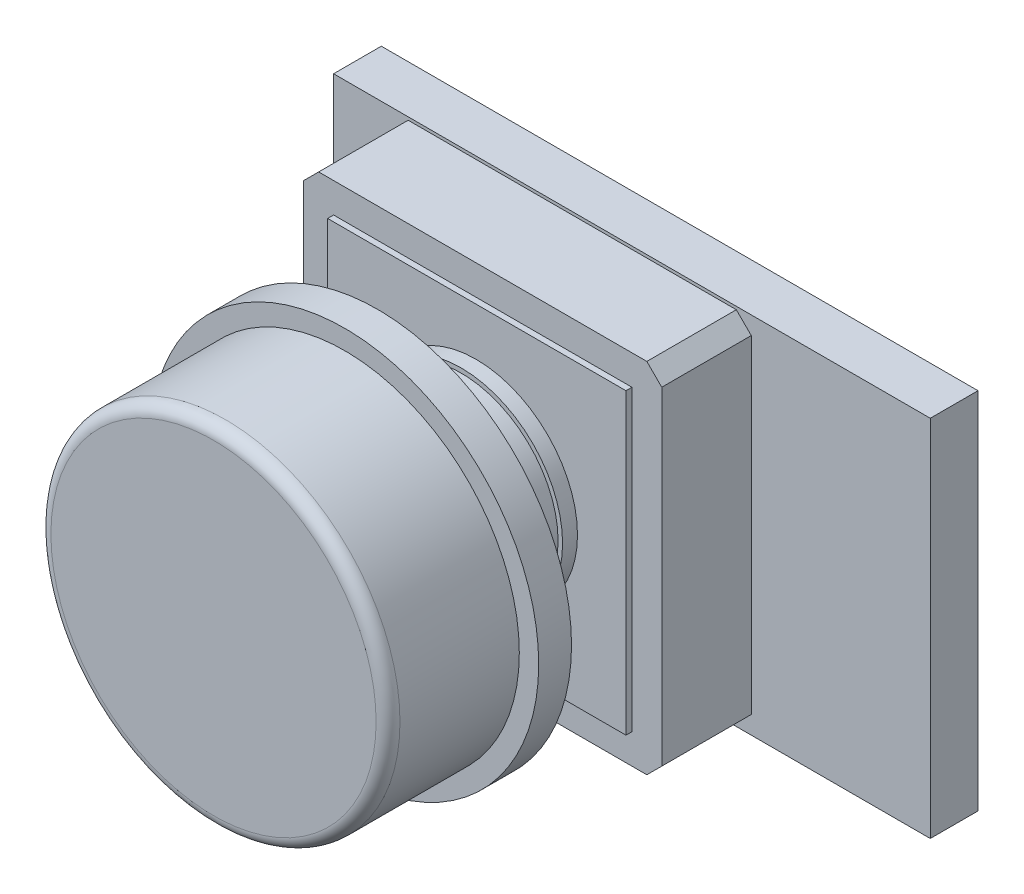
from build123d import *

# Parameters (mm, degrees)
SKETCH1_W           = 20
SKETCH1_H           = 12.2
BOSS_EXTRUDE1_DEPTH = 1.6
BOSS_EXTRU_1_DEPTH  = 3
ESQUISSE2_W         = 10
ESQUISSE2_H         = 10
BOSS_EXTRU_2_DEPTH  = 0.2
ESQUISSE3_R         = 3.4
BOSS_EXTRU_3_DEPTH  = 0.5
ESQUISSE5_W         = 1.960547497
ESQUISSE5_H         = 1.176328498
BOSS_EXTRU_4_DEPTH  = 0.5
BOSS_EXTRU_5_DEPTH  = 0.1


with BuildPart() as part:
    # Sketch1 → Boss-Extrude1 (new body)
    with BuildSketch(Plane.XY):
        with Locations((-3, 0)):
            Rectangle(SKETCH1_W, SKETCH1_H)
    extrude(amount=-BOSS_EXTRUDE1_DEPTH)

    # Esquisse1 → Boss.-Extru.1 (add)
    with BuildSketch(Plane.XY):
        Polygon((-10.5, 6), (0.5, 6), (1, 5.5), (1, -5.5), (0.5, -6), (-10.5, -6), (-11, -5.5), (-11, 5.5), align=None)
    extrude(amount=BOSS_EXTRU_1_DEPTH)

    # Esquisse2 → Boss.-Extru.2 (add)
    with BuildSketch(Plane.XY.offset(3)):
        with Locations((-5, 0)):
            Rectangle(ESQUISSE2_W, ESQUISSE2_H)
    extrude(amount=BOSS_EXTRU_2_DEPTH)

    # Esquisse3 → Boss.-Extru.3 (add)
    with BuildSketch(Plane.XY.offset(3.2)):
        with Locations(Location((-5.024392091, 0, 0), (0, 0, 180))):
            Circle(ESQUISSE3_R)
    extrude(amount=BOSS_EXTRU_3_DEPTH)

    # Esquisse4 → R_volution1 (revolve)
    with BuildSketch(Plane(origin=(0, 0, 0), x_dir=(1, 0, 0), z_dir=(0, 1, 0))):
        with BuildLine():
            Line((-5.024392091, -3.7), (-1.774392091, -3.7))
            Line((-1.774392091, -3.7), (-1.774392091, -6.5))
            Line((-1.774392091, -6.5), (1.475607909, -6.5))
            Line((1.475607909, -6.5), (1.475607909, -7.6))
            Line((1.475607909, -7.6), (0.825607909, -7.6))
            Line((0.825607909, -7.6), (0.825607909, -11.6))
            ThreePointArc((0.825607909, -11.6), (0.708450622, -11.882842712), (0.425607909, -12))
            Line((0.425607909, -12), (-5.024392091, -12))
            Line((-5.024392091, -12), (-5.024392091, -3.7))
        make_face()
    revolve(axis=Axis((-5.024392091, 0, 12), (0, 0, -1)))

    # Esquisse5 → Boss.-Extru.4 (add)
    with BuildSketch(Plane(origin=(0, 0, -1.6), x_dir=(-1, 0, 0), z_dir=(0, 0, -1))):
        with Locations((-2.67402441, 4.914439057)):
            Rectangle(ESQUISSE5_W, ESQUISSE5_H)
    extrude(amount=BOSS_EXTRU_4_DEPTH)

    # Esquisse6 → Boss.-Extru.5 (add)
    # profile 1 of 2: a face of its own
    with BuildSketch(Plane(origin=(0, 0, -1.6), x_dir=(-1, 0, 0), z_dir=(0, 0, -1))):
        with BuildLine():
            Line((-0.859748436, 5.483118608), (-0.659628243, 5.483118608))
            add(Edge.make_bspline(
                [(-0.659628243, 5.483118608), (-0.646273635, 5.483074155), (-0.620631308, 5.4829888), (-0.583896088, 5.482512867), (-0.550516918, 5.481148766), (-0.520511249, 5.479974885), (-0.493879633, 5.47783433), (-0.470540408, 5.475788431), (-0.450601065, 5.473110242), (-0.438530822, 5.470622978), (-0.433065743, 5.469496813)],
                knots=[0, 0, 0, 0, 1.410062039, 2.707475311, 3.878576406, 4.937260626, 5.877586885, 6.699081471, 7.410979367, 8, 8, 8, 8], degree=3))
            add(Edge.make_bspline(
                [(-0.433065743, 5.469496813), (-0.425749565, 5.467689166), (-0.411273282, 5.464112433), (-0.390430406, 5.456552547), (-0.370569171, 5.447804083), (-0.351772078, 5.437528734), (-0.334133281, 5.425650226), (-0.317470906, 5.412373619), (-0.301709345, 5.397771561), (-0.287486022, 5.381475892), (-0.274074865, 5.364379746), (-0.262763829, 5.345892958), (-0.253013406, 5.326561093), (-0.245250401, 5.306187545), (-0.238999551, 5.284969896), (-0.234592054, 5.262715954), (-0.231948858, 5.239527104), (-0.231679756, 5.223710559), (-0.231543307, 5.215690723)],
                knots=[0, 0, 0, 0, 1.027469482, 2.033020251, 3.019912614, 3.986113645, 4.951240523, 5.91722682, 6.890402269, 7.87763091, 8.8651537, 9.85103654, 10.82876324, 11.815024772, 12.821070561, 13.842952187, 14.906261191, 16, 16, 16, 16], degree=3))
            add(Edge.make_bspline(
                [(-0.231543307, 5.215690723), (-0.231963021, 5.202366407), (-0.232781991, 5.176367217), (-0.240417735, 5.138635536), (-0.252925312, 5.103438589), (-0.270160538, 5.070820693), (-0.292108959, 5.041417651), (-0.318487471, 5.015591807), (-0.349310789, 4.993980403), (-0.378004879, 4.978993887), (-0.403351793, 4.969395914), (-0.424218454, 4.962642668), (-0.446980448, 4.957424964), (-0.471419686, 4.95275064), (-0.497637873, 4.949221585), (-0.52557217, 4.946636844), (-0.555242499, 4.945021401), (-0.575625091, 4.944780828), (-0.586110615, 4.944657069)],
                knots=[0, 0, 0, 0, 1.260483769, 2.459530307, 3.627416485, 4.787058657, 5.939039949, 7.08810263, 8.267026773, 9.491475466, 10.141966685, 10.831826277, 11.566392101, 12.351337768, 13.187381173, 14.07005841, 15.007169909, 16, 16, 16, 16], degree=3))
            Line((-0.586110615, 4.944657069), (-0.218722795, 4.483118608))
            Line((-0.218722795, 4.483118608), (-0.329700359, 4.483118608))
            Line((-0.329700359, 4.483118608), (-0.697088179, 4.944657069))
            Line((-0.697088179, 4.944657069), (-0.770004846, 4.944657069))
            Line((-0.770004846, 4.944657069), (-0.770004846, 4.483118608))
            Line((-0.770004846, 4.483118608), (-0.859748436, 4.483118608))
            Line((-0.859748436, 4.483118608), (-0.859748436, 5.483118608))
        make_face()
        with BuildLine():
            Line((-0.770004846, 5.380554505), (-0.770004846, 5.047221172))
            Line((-0.770004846, 5.047221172), (-0.586911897, 5.045818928))
            add(Edge.make_bspline(
                [(-0.586911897, 5.045818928), (-0.578363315, 5.045815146), (-0.561793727, 5.045807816), (-0.537822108, 5.046948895), (-0.515502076, 5.048246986), (-0.494919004, 5.050232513), (-0.476063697, 5.052791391), (-0.458945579, 5.055992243), (-0.443536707, 5.059721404), (-0.425565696, 5.065493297), (-0.405498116, 5.074637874), (-0.383689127, 5.087942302), (-0.365117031, 5.104676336), (-0.349426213, 5.123811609), (-0.336817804, 5.144850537), (-0.327928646, 5.167540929), (-0.322287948, 5.191309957), (-0.321622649, 5.207646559), (-0.321286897, 5.215891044)],
                knots=[0, 0, 0, 0, 1.146690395, 2.22261258, 3.21895312, 4.145990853, 4.996080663, 5.770904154, 6.481378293, 7.121626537, 8.300444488, 9.431385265, 10.535395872, 11.636531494, 12.74115979, 13.810798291, 14.895190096, 16, 16, 16, 16], degree=3))
            add(Edge.make_bspline(
                [(-0.321286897, 5.215891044), (-0.32163036, 5.223932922), (-0.322310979, 5.23986899), (-0.32786777, 5.26319925), (-0.337264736, 5.285218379), (-0.349928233, 5.305836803), (-0.365356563, 5.324552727), (-0.383447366, 5.3405662), (-0.403705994, 5.353780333), (-0.422640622, 5.362224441), (-0.439564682, 5.367401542), (-0.454258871, 5.371044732), (-0.47086215, 5.373971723), (-0.489455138, 5.376316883), (-0.509958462, 5.378332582), (-0.53247579, 5.379690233), (-0.556857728, 5.380494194), (-0.573756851, 5.380533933), (-0.582504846, 5.380554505)],
                knots=[0, 0, 0, 0, 1.101028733, 2.181837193, 3.264309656, 4.369019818, 5.486613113, 6.575447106, 7.666700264, 8.788928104, 9.402425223, 10.0903467, 10.862060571, 11.710948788, 12.657782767, 13.684531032, 14.801375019, 16, 16, 16, 16], degree=3))
            Line((-0.582504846, 5.380554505), (-0.770004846, 5.380554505))
        make_face(mode=Mode.SUBTRACT)
    # profile 2 of 2: a face of its own
    with BuildSketch(Plane(origin=(0, 0, -1.6), x_dir=(-1, 0, 0), z_dir=(0, 0, -1))):
        Polygon((0.109201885, 5.483118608), (0.294097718, 5.483118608), (0.294097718, 4.483118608), (0.204354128, 4.483118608), (0.204354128, 5.380554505), (0.050507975, 5.380554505), align=None)
    extrude(amount=BOSS_EXTRU_5_DEPTH)


solid = part.part
